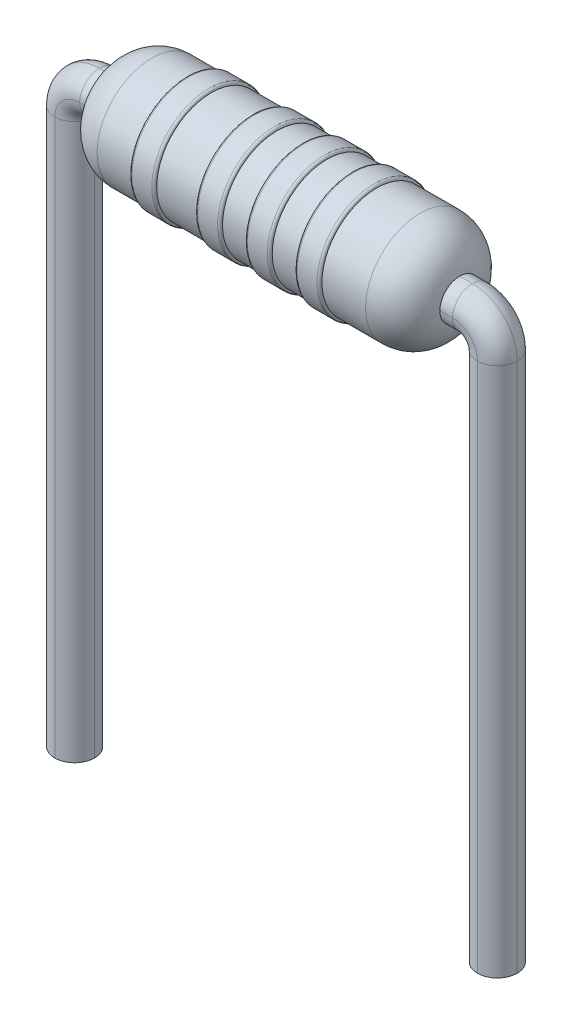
ISO-10303-21;
HEADER;
FILE_DESCRIPTION(('STEP AP214'),'2;1');
FILE_NAME('part.step','',(''),(''),'','','');
FILE_SCHEMA(('AUTOMOTIVE_DESIGN { 1 0 10303 214 1 1 1 1 }'));
ENDSEC;
DATA;
#1=APPLICATION_CONTEXT('core data for automotive mechanical design processes');
#2=APPLICATION_PROTOCOL_DEFINITION('international standard','automotive_design',2000,#1);
#3=PRODUCT_CONTEXT('',#1,'mechanical');
#4=PRODUCT('Part','Part','',(#3));
#5=PRODUCT_RELATED_PRODUCT_CATEGORY('part','',(#4));
#6=PRODUCT_DEFINITION_FORMATION('','',#4);
#7=PRODUCT_DEFINITION_CONTEXT('part definition',#1,'design');
#8=PRODUCT_DEFINITION('design','',#6,#7);
#9=PRODUCT_DEFINITION_SHAPE('','',#8);
#10=(LENGTH_UNIT() NAMED_UNIT(*) SI_UNIT(.MILLI.,.METRE.));
#11=(NAMED_UNIT(*) PLANE_ANGLE_UNIT() SI_UNIT($,.RADIAN.));
#12=(NAMED_UNIT(*) SI_UNIT($,.STERADIAN.) SOLID_ANGLE_UNIT());
#13=UNCERTAINTY_MEASURE_WITH_UNIT(LENGTH_MEASURE(1.E-05),#10,'distance_accuracy_value','');
#14=(GEOMETRIC_REPRESENTATION_CONTEXT(3) GLOBAL_UNCERTAINTY_ASSIGNED_CONTEXT((#13)) GLOBAL_UNIT_ASSIGNED_CONTEXT((#10,
#11,#12)) REPRESENTATION_CONTEXT('',''));
#15=CARTESIAN_POINT('',(0.,0.,0.));
#16=DIRECTION('',(0.,0.,1.));
#17=DIRECTION('',(1.,0.,0.));
#18=AXIS2_PLACEMENT_3D('',#15,#16,#17);
#19=CARTESIAN_POINT('',(2.7,0.,0.));
#20=DIRECTION('',(-1.,0.,0.));
#21=DIRECTION('',(0.,0.,1.));
#22=AXIS2_PLACEMENT_3D('',#19,#20,#21);
#23=DEGENERATE_TOROIDAL_SURFACE('',#22,0.3,0.8,.T.);
#24=CARTESIAN_POINT('',(3.49372539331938,0.,0.));
#25=DIRECTION('',(-1.,0.,0.));
#26=DIRECTION('',(0.,0.,1.));
#27=AXIS2_PLACEMENT_3D('',#24,#25,#26);
#28=CIRCLE('',#27,0.4);
#29=CARTESIAN_POINT('',(3.49372539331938,0.,-0.4));
#30=VERTEX_POINT('',#29);
#31=CARTESIAN_POINT('',(3.49372539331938,-0.4,0.));
#32=VERTEX_POINT('',#31);
#33=EDGE_CURVE('E31',#30,#32,#28,.T.);
#34=ORIENTED_EDGE('',*,*,#33,.T.);
#35=CARTESIAN_POINT('',(3.49372539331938,0.,0.));
#36=DIRECTION('',(1.,0.,0.));
#37=DIRECTION('',(0.,0.,-1.));
#38=AXIS2_PLACEMENT_3D('',#35,#36,#37);
#39=CIRCLE('',#38,0.4);
#40=CARTESIAN_POINT('',(3.49372539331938,0.,0.4));
#41=VERTEX_POINT('',#40);
#42=EDGE_CURVE('E11',#32,#41,#39,.F.);
#43=ORIENTED_EDGE('',*,*,#42,.T.);
#44=CARTESIAN_POINT('',(3.49372539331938,0.,0.));
#45=DIRECTION('',(-1.,0.,0.));
#46=DIRECTION('',(0.,0.,1.));
#47=AXIS2_PLACEMENT_3D('',#44,#45,#46);
#48=CIRCLE('',#47,0.4);
#49=CARTESIAN_POINT('',(3.49372539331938,0.4,0.));
#50=VERTEX_POINT('',#49);
#51=EDGE_CURVE('E339',#41,#50,#48,.T.);
#52=ORIENTED_EDGE('',*,*,#51,.T.);
#53=CARTESIAN_POINT('',(3.49372539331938,0.,0.));
#54=DIRECTION('',(1.,0.,0.));
#55=DIRECTION('',(0.,0.,-1.));
#56=AXIS2_PLACEMENT_3D('',#53,#54,#55);
#57=CIRCLE('',#56,0.4);
#58=EDGE_CURVE('E337',#50,#30,#57,.F.);
#59=ORIENTED_EDGE('',*,*,#58,.T.);
#60=EDGE_LOOP('',(#34,#43,#52,#59));
#61=FACE_BOUND('',#60,.T.);
#62=CARTESIAN_POINT('',(2.69999999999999,0.,0.));
#63=DIRECTION('',(-1.,0.,0.));
#64=DIRECTION('',(0.,0.,1.));
#65=AXIS2_PLACEMENT_3D('',#62,#63,#64);
#66=CIRCLE('',#65,1.1);
#67=CARTESIAN_POINT('',(2.69999999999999,0.,1.1));
#68=VERTEX_POINT('',#67);
#69=EDGE_CURVE('E269',#68,#68,#66,.T.);
#70=ORIENTED_EDGE('',*,*,#69,.F.);
#71=EDGE_LOOP('',(#70));
#72=FACE_BOUND('',#71,.T.);
#73=ADVANCED_FACE('F24',(#61,#72),#23,.T.);
#74=CARTESIAN_POINT('',(-2.7,0.,0.));
#75=DIRECTION('',(-1.,0.,0.));
#76=DIRECTION('',(0.,0.,1.));
#77=AXIS2_PLACEMENT_3D('',#74,#75,#76);
#78=DEGENERATE_TOROIDAL_SURFACE('',#77,0.3,0.8,.T.);
#79=CARTESIAN_POINT('',(-3.49372539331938,0.,0.));
#80=DIRECTION('',(-1.,0.,0.));
#81=DIRECTION('',(0.,0.,1.));
#82=AXIS2_PLACEMENT_3D('',#79,#80,#81);
#83=CIRCLE('',#82,0.4);
#84=CARTESIAN_POINT('',(-3.49372539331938,-0.4,0.));
#85=VERTEX_POINT('',#84);
#86=CARTESIAN_POINT('',(-3.49372539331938,0.,-0.4));
#87=VERTEX_POINT('',#86);
#88=EDGE_CURVE('E172',#85,#87,#83,.F.);
#89=ORIENTED_EDGE('',*,*,#88,.T.);
#90=CARTESIAN_POINT('',(-3.49372539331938,0.,0.));
#91=DIRECTION('',(1.,0.,0.));
#92=DIRECTION('',(0.,0.,-1.));
#93=AXIS2_PLACEMENT_3D('',#90,#91,#92);
#94=CIRCLE('',#93,0.4);
#95=CARTESIAN_POINT('',(-3.49372539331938,0.4,0.));
#96=VERTEX_POINT('',#95);
#97=EDGE_CURVE('E44',#87,#96,#94,.T.);
#98=ORIENTED_EDGE('',*,*,#97,.T.);
#99=CARTESIAN_POINT('',(-3.49372539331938,0.,0.));
#100=DIRECTION('',(-1.,0.,0.));
#101=DIRECTION('',(0.,0.,1.));
#102=AXIS2_PLACEMENT_3D('',#99,#100,#101);
#103=CIRCLE('',#102,0.4);
#104=CARTESIAN_POINT('',(-3.49372539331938,0.,0.4));
#105=VERTEX_POINT('',#104);
#106=EDGE_CURVE('E344',#96,#105,#103,.F.);
#107=ORIENTED_EDGE('',*,*,#106,.T.);
#108=CARTESIAN_POINT('',(-3.49372539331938,0.,0.));
#109=DIRECTION('',(1.,0.,0.));
#110=DIRECTION('',(0.,0.,-1.));
#111=AXIS2_PLACEMENT_3D('',#108,#109,#110);
#112=CIRCLE('',#111,0.4);
#113=EDGE_CURVE('E342',#105,#85,#112,.T.);
#114=ORIENTED_EDGE('',*,*,#113,.T.);
#115=EDGE_LOOP('',(#89,#98,#107,#114));
#116=FACE_BOUND('',#115,.T.);
#117=CARTESIAN_POINT('',(-2.69999999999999,0.,0.));
#118=DIRECTION('',(-1.,0.,0.));
#119=DIRECTION('',(0.,0.,1.));
#120=AXIS2_PLACEMENT_3D('',#117,#118,#119);
#121=CIRCLE('',#120,1.1);
#122=CARTESIAN_POINT('',(-2.69999999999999,0.,1.1));
#123=VERTEX_POINT('',#122);
#124=EDGE_CURVE('E266',#123,#123,#121,.T.);
#125=ORIENTED_EDGE('',*,*,#124,.T.);
#126=EDGE_LOOP('',(#125));
#127=FACE_BOUND('',#126,.T.);
#128=ADVANCED_FACE('F346',(#116,#127),#78,.T.);
#129=CARTESIAN_POINT('',(-54.2686615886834,0.,0.));
#130=DIRECTION('',(-1.,0.,0.));
#131=DIRECTION('',(0.,0.,1.));
#132=AXIS2_PLACEMENT_3D('',#129,#130,#131);
#133=CYLINDRICAL_SURFACE('',#132,1.1);
#134=CARTESIAN_POINT('',(0.322975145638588,0.,0.));
#135=DIRECTION('',(-1.,0.,0.));
#136=DIRECTION('',(0.,0.,1.));
#137=AXIS2_PLACEMENT_3D('',#134,#135,#136);
#138=CIRCLE('',#137,1.1);
#139=CARTESIAN_POINT('',(0.322975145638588,0.,1.1));
#140=VERTEX_POINT('',#139);
#141=EDGE_CURVE('E280',#140,#140,#138,.T.);
#142=ORIENTED_EDGE('',*,*,#141,.T.);
#143=EDGE_LOOP('',(#142));
#144=FACE_BOUND('',#143,.T.);
#145=CARTESIAN_POINT('',(-0.177024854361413,0.,0.));
#146=DIRECTION('',(1.,0.,0.));
#147=DIRECTION('',(0.,0.,-1.));
#148=AXIS2_PLACEMENT_3D('',#145,#146,#147);
#149=CIRCLE('',#148,1.1);
#150=CARTESIAN_POINT('',(-0.177024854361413,0.,-1.1));
#151=VERTEX_POINT('',#150);
#152=EDGE_CURVE('E270',#151,#151,#149,.T.);
#153=ORIENTED_EDGE('',*,*,#152,.T.);
#154=EDGE_LOOP('',(#153));
#155=FACE_BOUND('',#154,.T.);
#156=ADVANCED_FACE('F383',(#144,#155),#133,.T.);
#157=CARTESIAN_POINT('',(4.3261723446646,0.,0.));
#158=DIRECTION('',(1.,0.,0.));
#159=DIRECTION('',(0.,0.,-1.));
#160=AXIS2_PLACEMENT_3D('',#157,#158,#159);
#161=CYLINDRICAL_SURFACE('',#160,1.15);
#162=CARTESIAN_POINT('',(-0.627024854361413,0.,0.));
#163=DIRECTION('',(-1.,0.,0.));
#164=DIRECTION('',(0.,0.,1.));
#165=AXIS2_PLACEMENT_3D('',#162,#163,#164);
#166=CIRCLE('',#165,1.15);
#167=CARTESIAN_POINT('',(-0.627024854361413,0.,1.15));
#168=VERTEX_POINT('',#167);
#169=EDGE_CURVE('E304',#168,#168,#166,.F.);
#170=ORIENTED_EDGE('',*,*,#169,.T.);
#171=EDGE_LOOP('',(#170));
#172=FACE_BOUND('',#171,.T.);
#173=CARTESIAN_POINT('',(-0.227024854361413,0.,0.));
#174=DIRECTION('',(1.,0.,0.));
#175=DIRECTION('',(0.,0.,-1.));
#176=AXIS2_PLACEMENT_3D('',#173,#174,#175);
#177=CIRCLE('',#176,1.15);
#178=CARTESIAN_POINT('',(-0.227024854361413,0.,-1.15));
#179=VERTEX_POINT('',#178);
#180=EDGE_CURVE('E301',#179,#179,#177,.F.);
#181=ORIENTED_EDGE('',*,*,#180,.T.);
#182=EDGE_LOOP('',(#181));
#183=FACE_BOUND('',#182,.T.);
#184=ADVANCED_FACE('F418',(#172,#183),#161,.T.);
#185=CARTESIAN_POINT('',(-1.5,0.,0.));
#186=DIRECTION('',(1.,0.,0.));
#187=DIRECTION('',(0.,0.,-1.));
#188=AXIS2_PLACEMENT_3D('',#185,#186,#187);
#189=CIRCLE('',#188,1.1);
#190=CARTESIAN_POINT('',(-1.5,0.,-1.1));
#191=VERTEX_POINT('',#190);
#192=EDGE_CURVE('E265',#191,#191,#189,.T.);
#193=ORIENTED_EDGE('',*,*,#192,.T.);
#194=EDGE_LOOP('',(#193));
#195=FACE_BOUND('',#194,.T.);
#196=CARTESIAN_POINT('',(-0.677024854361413,0.,0.));
#197=DIRECTION('',(-1.,0.,0.));
#198=DIRECTION('',(0.,0.,1.));
#199=AXIS2_PLACEMENT_3D('',#196,#197,#198);
#200=CIRCLE('',#199,1.1);
#201=CARTESIAN_POINT('',(-0.677024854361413,0.,1.1));
#202=VERTEX_POINT('',#201);
#203=EDGE_CURVE('E274',#202,#202,#200,.T.);
#204=ORIENTED_EDGE('',*,*,#203,.T.);
#205=EDGE_LOOP('',(#204));
#206=FACE_BOUND('',#205,.T.);
#207=ADVANCED_FACE('F403',(#195,#206),#133,.T.);
#208=CARTESIAN_POINT('',(4.3261723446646,0.,0.));
#209=DIRECTION('',(1.,0.,0.));
#210=DIRECTION('',(0.,0.,-1.));
#211=AXIS2_PLACEMENT_3D('',#208,#209,#210);
#212=CYLINDRICAL_SURFACE('',#211,1.15);
#213=CARTESIAN_POINT('',(0.372975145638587,0.,0.));
#214=DIRECTION('',(-1.,0.,0.));
#215=DIRECTION('',(0.,0.,1.));
#216=AXIS2_PLACEMENT_3D('',#213,#214,#215);
#217=CIRCLE('',#216,1.15);
#218=CARTESIAN_POINT('',(0.372975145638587,0.,1.15));
#219=VERTEX_POINT('',#218);
#220=EDGE_CURVE('E310',#219,#219,#217,.F.);
#221=ORIENTED_EDGE('',*,*,#220,.T.);
#222=EDGE_LOOP('',(#221));
#223=FACE_BOUND('',#222,.T.);
#224=CARTESIAN_POINT('',(0.772975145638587,0.,0.));
#225=DIRECTION('',(1.,0.,0.));
#226=DIRECTION('',(0.,0.,-1.));
#227=AXIS2_PLACEMENT_3D('',#224,#225,#226);
#228=CIRCLE('',#227,1.15);
#229=CARTESIAN_POINT('',(0.772975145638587,0.,-1.15));
#230=VERTEX_POINT('',#229);
#231=EDGE_CURVE('E307',#230,#230,#228,.F.);
#232=ORIENTED_EDGE('',*,*,#231,.T.);
#233=EDGE_LOOP('',(#232));
#234=FACE_BOUND('',#233,.T.);
#235=ADVANCED_FACE('F405',(#223,#234),#212,.T.);
#236=CARTESIAN_POINT('',(1.32297514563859,0.,0.));
#237=DIRECTION('',(-1.,0.,0.));
#238=DIRECTION('',(0.,0.,1.));
#239=AXIS2_PLACEMENT_3D('',#236,#237,#238);
#240=CIRCLE('',#239,1.1);
#241=CARTESIAN_POINT('',(1.32297514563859,0.,1.1));
#242=VERTEX_POINT('',#241);
#243=EDGE_CURVE('E286',#242,#242,#240,.T.);
#244=ORIENTED_EDGE('',*,*,#243,.T.);
#245=EDGE_LOOP('',(#244));
#246=FACE_BOUND('',#245,.T.);
#247=CARTESIAN_POINT('',(0.822975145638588,0.,0.));
#248=DIRECTION('',(1.,0.,0.));
#249=DIRECTION('',(0.,0.,-1.));
#250=AXIS2_PLACEMENT_3D('',#247,#248,#249);
#251=CIRCLE('',#250,1.1);
#252=CARTESIAN_POINT('',(0.822975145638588,0.,-1.1));
#253=VERTEX_POINT('',#252);
#254=EDGE_CURVE('E277',#253,#253,#251,.T.);
#255=ORIENTED_EDGE('',*,*,#254,.T.);
#256=EDGE_LOOP('',(#255));
#257=FACE_BOUND('',#256,.T.);
#258=ADVANCED_FACE('F393',(#246,#257),#133,.T.);
#259=CARTESIAN_POINT('',(4.3261723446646,0.,0.));
#260=DIRECTION('',(1.,0.,0.));
#261=DIRECTION('',(0.,0.,-1.));
#262=AXIS2_PLACEMENT_3D('',#259,#260,#261);
#263=CYLINDRICAL_SURFACE('',#262,1.15);
#264=CARTESIAN_POINT('',(1.37297514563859,0.,0.));
#265=DIRECTION('',(-1.,0.,0.));
#266=DIRECTION('',(0.,0.,1.));
#267=AXIS2_PLACEMENT_3D('',#264,#265,#266);
#268=CIRCLE('',#267,1.15);
#269=CARTESIAN_POINT('',(1.37297514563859,0.,1.15));
#270=VERTEX_POINT('',#269);
#271=EDGE_CURVE('E316',#270,#270,#268,.F.);
#272=ORIENTED_EDGE('',*,*,#271,.T.);
#273=EDGE_LOOP('',(#272));
#274=FACE_BOUND('',#273,.T.);
#275=CARTESIAN_POINT('',(1.77297514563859,0.,0.));
#276=DIRECTION('',(1.,0.,0.));
#277=DIRECTION('',(0.,0.,-1.));
#278=AXIS2_PLACEMENT_3D('',#275,#276,#277);
#279=CIRCLE('',#278,1.15);
#280=CARTESIAN_POINT('',(1.77297514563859,0.,-1.15));
#281=VERTEX_POINT('',#280);
#282=EDGE_CURVE('E313',#281,#281,#279,.F.);
#283=ORIENTED_EDGE('',*,*,#282,.T.);
#284=EDGE_LOOP('',(#283));
#285=FACE_BOUND('',#284,.T.);
#286=ADVANCED_FACE('F391',(#274,#285),#263,.T.);
#287=CARTESIAN_POINT('',(1.82297514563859,0.,0.));
#288=DIRECTION('',(1.,0.,0.));
#289=DIRECTION('',(0.,0.,-1.));
#290=AXIS2_PLACEMENT_3D('',#287,#288,#289);
#291=CIRCLE('',#290,1.1);
#292=CARTESIAN_POINT('',(1.82297514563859,0.,-1.1));
#293=VERTEX_POINT('',#292);
#294=EDGE_CURVE('E283',#293,#293,#291,.T.);
#295=ORIENTED_EDGE('',*,*,#294,.T.);
#296=EDGE_LOOP('',(#295));
#297=FACE_BOUND('',#296,.T.);
#298=ORIENTED_EDGE('',*,*,#69,.T.);
#299=EDGE_LOOP('',(#298));
#300=FACE_BOUND('',#299,.T.);
#301=ADVANCED_FACE('F388',(#297,#300),#133,.T.);
#302=CARTESIAN_POINT('',(4.3261723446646,0.,0.));
#303=DIRECTION('',(1.,0.,0.));
#304=DIRECTION('',(0.,0.,-1.));
#305=AXIS2_PLACEMENT_3D('',#302,#303,#304);
#306=CYLINDRICAL_SURFACE('',#305,1.15);
#307=CARTESIAN_POINT('',(-1.95,0.,0.));
#308=DIRECTION('',(-1.,0.,0.));
#309=DIRECTION('',(0.,0.,1.));
#310=AXIS2_PLACEMENT_3D('',#307,#308,#309);
#311=CIRCLE('',#310,1.15);
#312=CARTESIAN_POINT('',(-1.95,0.,1.15));
#313=VERTEX_POINT('',#312);
#314=EDGE_CURVE('E298',#313,#313,#311,.F.);
#315=ORIENTED_EDGE('',*,*,#314,.T.);
#316=EDGE_LOOP('',(#315));
#317=FACE_BOUND('',#316,.T.);
#318=CARTESIAN_POINT('',(-1.55,0.,0.));
#319=DIRECTION('',(1.,0.,0.));
#320=DIRECTION('',(0.,0.,-1.));
#321=AXIS2_PLACEMENT_3D('',#318,#319,#320);
#322=CIRCLE('',#321,1.15);
#323=CARTESIAN_POINT('',(-1.55,0.,-1.15));
#324=VERTEX_POINT('',#323);
#325=EDGE_CURVE('E273',#324,#324,#322,.F.);
#326=ORIENTED_EDGE('',*,*,#325,.T.);
#327=EDGE_LOOP('',(#326));
#328=FACE_BOUND('',#327,.T.);
#329=ADVANCED_FACE('F390',(#317,#328),#306,.T.);
#330=CARTESIAN_POINT('',(-2.,0.,0.));
#331=DIRECTION('',(-1.,0.,0.));
#332=DIRECTION('',(0.,0.,1.));
#333=AXIS2_PLACEMENT_3D('',#330,#331,#332);
#334=CIRCLE('',#333,1.1);
#335=CARTESIAN_POINT('',(-2.,0.,1.1));
#336=VERTEX_POINT('',#335);
#337=EDGE_CURVE('E289',#336,#336,#334,.T.);
#338=ORIENTED_EDGE('',*,*,#337,.T.);
#339=EDGE_LOOP('',(#338));
#340=FACE_BOUND('',#339,.T.);
#341=ORIENTED_EDGE('',*,*,#124,.F.);
#342=EDGE_LOOP('',(#341));
#343=FACE_BOUND('',#342,.T.);
#344=ADVANCED_FACE('F394',(#340,#343),#133,.T.);
#345=CARTESIAN_POINT('',(-1.95,0.,0.));
#346=DIRECTION('',(-1.,0.,0.));
#347=DIRECTION('',(0.,0.,1.));
#348=AXIS2_PLACEMENT_3D('',#345,#346,#347);
#349=TOROIDAL_SURFACE('',#348,1.1,0.05);
#350=ORIENTED_EDGE('',*,*,#337,.F.);
#351=EDGE_LOOP('',(#350));
#352=FACE_BOUND('',#351,.T.);
#353=ORIENTED_EDGE('',*,*,#314,.F.);
#354=EDGE_LOOP('',(#353));
#355=FACE_BOUND('',#354,.T.);
#356=ADVANCED_FACE('F408',(#352,#355),#349,.T.);
#357=CARTESIAN_POINT('',(-1.55,0.,0.));
#358=DIRECTION('',(1.,0.,0.));
#359=DIRECTION('',(0.,0.,-1.));
#360=AXIS2_PLACEMENT_3D('',#357,#358,#359);
#361=TOROIDAL_SURFACE('',#360,1.1,0.05);
#362=ORIENTED_EDGE('',*,*,#325,.F.);
#363=EDGE_LOOP('',(#362));
#364=FACE_BOUND('',#363,.T.);
#365=ORIENTED_EDGE('',*,*,#192,.F.);
#366=EDGE_LOOP('',(#365));
#367=FACE_BOUND('',#366,.T.);
#368=ADVANCED_FACE('F413',(#364,#367),#361,.T.);
#369=CARTESIAN_POINT('',(-0.627024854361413,0.,0.));
#370=DIRECTION('',(-1.,0.,0.));
#371=DIRECTION('',(0.,0.,1.));
#372=AXIS2_PLACEMENT_3D('',#369,#370,#371);
#373=TOROIDAL_SURFACE('',#372,1.1,0.05);
#374=ORIENTED_EDGE('',*,*,#203,.F.);
#375=EDGE_LOOP('',(#374));
#376=FACE_BOUND('',#375,.T.);
#377=ORIENTED_EDGE('',*,*,#169,.F.);
#378=EDGE_LOOP('',(#377));
#379=FACE_BOUND('',#378,.T.);
#380=ADVANCED_FACE('F440',(#376,#379),#373,.T.);
#381=CARTESIAN_POINT('',(-0.227024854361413,0.,0.));
#382=DIRECTION('',(1.,0.,0.));
#383=DIRECTION('',(0.,0.,-1.));
#384=AXIS2_PLACEMENT_3D('',#381,#382,#383);
#385=TOROIDAL_SURFACE('',#384,1.1,0.05);
#386=ORIENTED_EDGE('',*,*,#180,.F.);
#387=EDGE_LOOP('',(#386));
#388=FACE_BOUND('',#387,.T.);
#389=ORIENTED_EDGE('',*,*,#152,.F.);
#390=EDGE_LOOP('',(#389));
#391=FACE_BOUND('',#390,.T.);
#392=ADVANCED_FACE('F437',(#388,#391),#385,.T.);
#393=CARTESIAN_POINT('',(0.372975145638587,0.,0.));
#394=DIRECTION('',(-1.,0.,0.));
#395=DIRECTION('',(0.,0.,1.));
#396=AXIS2_PLACEMENT_3D('',#393,#394,#395);
#397=TOROIDAL_SURFACE('',#396,1.1,0.05);
#398=ORIENTED_EDGE('',*,*,#141,.F.);
#399=EDGE_LOOP('',(#398));
#400=FACE_BOUND('',#399,.T.);
#401=ORIENTED_EDGE('',*,*,#220,.F.);
#402=EDGE_LOOP('',(#401));
#403=FACE_BOUND('',#402,.T.);
#404=ADVANCED_FACE('F439',(#400,#403),#397,.T.);
#405=CARTESIAN_POINT('',(0.772975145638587,0.,0.));
#406=DIRECTION('',(1.,0.,0.));
#407=DIRECTION('',(0.,0.,-1.));
#408=AXIS2_PLACEMENT_3D('',#405,#406,#407);
#409=TOROIDAL_SURFACE('',#408,1.1,0.05);
#410=ORIENTED_EDGE('',*,*,#231,.F.);
#411=EDGE_LOOP('',(#410));
#412=FACE_BOUND('',#411,.T.);
#413=ORIENTED_EDGE('',*,*,#254,.F.);
#414=EDGE_LOOP('',(#413));
#415=FACE_BOUND('',#414,.T.);
#416=ADVANCED_FACE('F447',(#412,#415),#409,.T.);
#417=CARTESIAN_POINT('',(1.37297514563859,0.,0.));
#418=DIRECTION('',(-1.,0.,0.));
#419=DIRECTION('',(0.,0.,1.));
#420=AXIS2_PLACEMENT_3D('',#417,#418,#419);
#421=TOROIDAL_SURFACE('',#420,1.1,0.05);
#422=ORIENTED_EDGE('',*,*,#243,.F.);
#423=EDGE_LOOP('',(#422));
#424=FACE_BOUND('',#423,.T.);
#425=ORIENTED_EDGE('',*,*,#271,.F.);
#426=EDGE_LOOP('',(#425));
#427=FACE_BOUND('',#426,.T.);
#428=ADVANCED_FACE('F535',(#424,#427),#421,.T.);
#429=CARTESIAN_POINT('',(1.77297514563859,0.,0.));
#430=DIRECTION('',(1.,0.,0.));
#431=DIRECTION('',(0.,0.,-1.));
#432=AXIS2_PLACEMENT_3D('',#429,#430,#431);
#433=TOROIDAL_SURFACE('',#432,1.1,0.05);
#434=ORIENTED_EDGE('',*,*,#282,.F.);
#435=EDGE_LOOP('',(#434));
#436=FACE_BOUND('',#435,.T.);
#437=ORIENTED_EDGE('',*,*,#294,.F.);
#438=EDGE_LOOP('',(#437));
#439=FACE_BOUND('',#438,.T.);
#440=ADVANCED_FACE('F516',(#436,#439),#433,.T.);
#441=CARTESIAN_POINT('',(-3.85,-11.6643596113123,0.4));
#442=DIRECTION('',(0.,1.,0.));
#443=DIRECTION('',(0.,0.,1.));
#444=AXIS2_PLACEMENT_3D('',#441,#442,#443);
#445=PLANE('',#444);
#446=CARTESIAN_POINT('',(-4.25,-11.6643596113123,0.));
#447=DIRECTION('',(0.,1.,0.));
#448=DIRECTION('',(0.,0.,1.));
#449=AXIS2_PLACEMENT_3D('',#446,#447,#448);
#450=CIRCLE('',#449,0.4);
#451=CARTESIAN_POINT('',(-4.65,-11.6643596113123,0.));
#452=VERTEX_POINT('',#451);
#453=CARTESIAN_POINT('',(-4.25,-11.6643596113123,-0.4));
#454=VERTEX_POINT('',#453);
#455=EDGE_CURVE('E328',#452,#454,#450,.F.);
#456=ORIENTED_EDGE('',*,*,#455,.T.);
#457=CARTESIAN_POINT('',(-4.25,-11.6643596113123,0.));
#458=DIRECTION('',(0.,1.,0.));
#459=DIRECTION('',(0.,0.,1.));
#460=AXIS2_PLACEMENT_3D('',#457,#458,#459);
#461=CIRCLE('',#460,0.4);
#462=CARTESIAN_POINT('',(-3.85,-11.6643596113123,0.));
#463=VERTEX_POINT('',#462);
#464=EDGE_CURVE('E334',#454,#463,#461,.F.);
#465=ORIENTED_EDGE('',*,*,#464,.T.);
#466=CARTESIAN_POINT('',(-4.25,-11.6643596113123,0.));
#467=DIRECTION('',(0.,1.,0.));
#468=DIRECTION('',(0.,0.,1.));
#469=AXIS2_PLACEMENT_3D('',#466,#467,#468);
#470=CIRCLE('',#469,0.4);
#471=CARTESIAN_POINT('',(-4.25,-11.6643596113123,0.4));
#472=VERTEX_POINT('',#471);
#473=EDGE_CURVE('E332',#463,#472,#470,.F.);
#474=ORIENTED_EDGE('',*,*,#473,.T.);
#475=CARTESIAN_POINT('',(-4.25,-11.6643596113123,0.));
#476=DIRECTION('',(0.,1.,0.));
#477=DIRECTION('',(0.,0.,1.));
#478=AXIS2_PLACEMENT_3D('',#475,#476,#477);
#479=CIRCLE('',#478,0.4);
#480=EDGE_CURVE('E330',#472,#452,#479,.F.);
#481=ORIENTED_EDGE('',*,*,#480,.T.);
#482=EDGE_LOOP('',(#456,#465,#474,#481));
#483=FACE_BOUND('',#482,.T.);
#484=ADVANCED_FACE('F510',(#483),#445,.F.);
#485=CARTESIAN_POINT('',(4.65,-11.1630338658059,0.4));
#486=DIRECTION('',(0.,1.,0.));
#487=DIRECTION('',(0.,0.,1.));
#488=AXIS2_PLACEMENT_3D('',#485,#486,#487);
#489=PLANE('',#488);
#490=CARTESIAN_POINT('',(4.25,-11.1630338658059,0.));
#491=DIRECTION('',(0.,1.,0.));
#492=DIRECTION('',(0.,0.,1.));
#493=AXIS2_PLACEMENT_3D('',#490,#491,#492);
#494=CIRCLE('',#493,0.4);
#495=CARTESIAN_POINT('',(3.85,-11.1630338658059,0.));
#496=VERTEX_POINT('',#495);
#497=CARTESIAN_POINT('',(4.25,-11.1630338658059,-0.4));
#498=VERTEX_POINT('',#497);
#499=EDGE_CURVE('E321',#496,#498,#494,.F.);
#500=ORIENTED_EDGE('',*,*,#499,.T.);
#501=CARTESIAN_POINT('',(4.25,-11.1630338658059,0.));
#502=DIRECTION('',(0.,1.,0.));
#503=DIRECTION('',(0.,0.,1.));
#504=AXIS2_PLACEMENT_3D('',#501,#502,#503);
#505=CIRCLE('',#504,0.4);
#506=CARTESIAN_POINT('',(4.65,-11.1630338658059,0.));
#507=VERTEX_POINT('',#506);
#508=EDGE_CURVE('E325',#498,#507,#505,.F.);
#509=ORIENTED_EDGE('',*,*,#508,.T.);
#510=CARTESIAN_POINT('',(4.25,-11.1630338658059,0.));
#511=DIRECTION('',(0.,1.,0.));
#512=DIRECTION('',(0.,0.,1.));
#513=AXIS2_PLACEMENT_3D('',#510,#511,#512);
#514=CIRCLE('',#513,0.4);
#515=CARTESIAN_POINT('',(4.25,-11.1630338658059,0.4));
#516=VERTEX_POINT('',#515);
#517=EDGE_CURVE('E323',#507,#516,#514,.F.);
#518=ORIENTED_EDGE('',*,*,#517,.T.);
#519=CARTESIAN_POINT('',(4.25,-11.1630338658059,0.));
#520=DIRECTION('',(0.,1.,0.));
#521=DIRECTION('',(0.,0.,1.));
#522=AXIS2_PLACEMENT_3D('',#519,#520,#521);
#523=CIRCLE('',#522,0.4);
#524=EDGE_CURVE('E319',#516,#496,#523,.F.);
#525=ORIENTED_EDGE('',*,*,#524,.T.);
#526=EDGE_LOOP('',(#500,#509,#518,#525));
#527=FACE_BOUND('',#526,.T.);
#528=ADVANCED_FACE('F515',(#527),#489,.F.);
#529=CARTESIAN_POINT('',(4.25,-0.5,0.));
#530=DIRECTION('',(0.,-1.,0.));
#531=DIRECTION('',(0.,0.,-1.));
#532=AXIS2_PLACEMENT_3D('',#529,#530,#531);
#533=CYLINDRICAL_SURFACE('',#532,0.4);
#534=DIRECTION('',(0.,-1.,0.));
#535=VECTOR('',#534,1.);
#536=CARTESIAN_POINT('',(3.85,-11.1630338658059,0.));
#537=LINE('',#536,#535);
#538=CARTESIAN_POINT('',(3.85,-0.500000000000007,0.));
#539=VERTEX_POINT('',#538);
#540=EDGE_CURVE('E263',#496,#539,#537,.F.);
#541=ORIENTED_EDGE('',*,*,#540,.F.);
#542=ORIENTED_EDGE('',*,*,#524,.F.);
#543=DIRECTION('',(0.,-1.,0.));
#544=VECTOR('',#543,1.);
#545=CARTESIAN_POINT('',(4.25,-0.5,0.4));
#546=LINE('',#545,#544);
#547=CARTESIAN_POINT('',(4.25,-0.500000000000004,0.4));
#548=VERTEX_POINT('',#547);
#549=EDGE_CURVE('E260',#548,#516,#546,.T.);
#550=ORIENTED_EDGE('',*,*,#549,.F.);
#551=CARTESIAN_POINT('',(4.25,-0.500000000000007,0.));
#552=DIRECTION('',(0.,1.,0.));
#553=DIRECTION('',(0.,0.,1.));
#554=AXIS2_PLACEMENT_3D('',#551,#552,#553);
#555=CIRCLE('',#554,0.4);
#556=EDGE_CURVE('E257',#539,#548,#555,.T.);
#557=ORIENTED_EDGE('',*,*,#556,.F.);
#558=EDGE_LOOP('',(#541,#542,#550,#557));
#559=FACE_BOUND('',#558,.T.);
#560=ADVANCED_FACE('F524',(#559),#533,.T.);
#561=CARTESIAN_POINT('',(4.25,-11.1630338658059,0.));
#562=DIRECTION('',(0.,1.,0.));
#563=DIRECTION('',(0.,0.,1.));
#564=AXIS2_PLACEMENT_3D('',#561,#562,#563);
#565=CYLINDRICAL_SURFACE('',#564,0.4);
#566=ORIENTED_EDGE('',*,*,#499,.F.);
#567=ORIENTED_EDGE('',*,*,#540,.T.);
#568=CARTESIAN_POINT('',(4.25,-0.500000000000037,0.));
#569=DIRECTION('',(0.,1.,0.));
#570=DIRECTION('',(-1.,0.,0.));
#571=AXIS2_PLACEMENT_3D('',#568,#569,#570);
#572=CIRCLE('',#571,0.4);
#573=CARTESIAN_POINT('',(4.25,-0.500000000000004,-0.4));
#574=VERTEX_POINT('',#573);
#575=EDGE_CURVE('E252',#574,#539,#572,.T.);
#576=ORIENTED_EDGE('',*,*,#575,.F.);
#577=DIRECTION('',(0.,-1.,0.));
#578=VECTOR('',#577,1.);
#579=CARTESIAN_POINT('',(4.25,-0.500000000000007,-0.4));
#580=LINE('',#579,#578);
#581=EDGE_CURVE('E249',#498,#574,#580,.F.);
#582=ORIENTED_EDGE('',*,*,#581,.F.);
#583=EDGE_LOOP('',(#566,#567,#576,#582));
#584=FACE_BOUND('',#583,.T.);
#585=ADVANCED_FACE('F558',(#584),#565,.T.);
#586=CARTESIAN_POINT('',(4.25,-0.5,0.));
#587=DIRECTION('',(0.,1.,0.));
#588=DIRECTION('',(0.,0.,1.));
#589=AXIS2_PLACEMENT_3D('',#586,#587,#588);
#590=CYLINDRICAL_SURFACE('',#589,0.4);
#591=ORIENTED_EDGE('',*,*,#549,.T.);
#592=ORIENTED_EDGE('',*,*,#517,.F.);
#593=DIRECTION('',(0.,1.,0.));
#594=VECTOR('',#593,1.);
#595=CARTESIAN_POINT('',(4.65,-11.1630338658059,0.));
#596=LINE('',#595,#594);
#597=CARTESIAN_POINT('',(4.65,-0.500000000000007,0.));
#598=VERTEX_POINT('',#597);
#599=EDGE_CURVE('E247',#598,#507,#596,.F.);
#600=ORIENTED_EDGE('',*,*,#599,.F.);
#601=CARTESIAN_POINT('',(4.25,-0.500000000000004,0.));
#602=DIRECTION('',(0.,1.,0.));
#603=DIRECTION('',(-1.,0.,0.));
#604=AXIS2_PLACEMENT_3D('',#601,#602,#603);
#605=CIRCLE('',#604,0.4);
#606=EDGE_CURVE('E244',#548,#598,#605,.T.);
#607=ORIENTED_EDGE('',*,*,#606,.F.);
#608=EDGE_LOOP('',(#591,#592,#600,#607));
#609=FACE_BOUND('',#608,.T.);
#610=ADVANCED_FACE('F562',(#609),#590,.T.);
#611=CARTESIAN_POINT('',(3.75,-0.5,0.));
#612=DIRECTION('',(0.,0.,-1.));
#613=DIRECTION('',(-1.,0.,0.));
#614=AXIS2_PLACEMENT_3D('',#611,#612,#613);
#615=TOROIDAL_SURFACE('',#614,0.5,0.4);
#616=CARTESIAN_POINT('',(3.75,-0.5,0.));
#617=DIRECTION('',(0.,0.,-1.));
#618=DIRECTION('',(-1.,0.,0.));
#619=AXIS2_PLACEMENT_3D('',#616,#617,#618);
#620=CIRCLE('',#619,0.0999999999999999);
#621=CARTESIAN_POINT('',(3.75,-0.4,0.));
#622=VERTEX_POINT('',#621);
#623=EDGE_CURVE('E255',#539,#622,#620,.F.);
#624=ORIENTED_EDGE('',*,*,#623,.F.);
#625=ORIENTED_EDGE('',*,*,#556,.T.);
#626=CARTESIAN_POINT('',(3.75,-0.5,0.4));
#627=DIRECTION('',(0.,0.,-1.));
#628=DIRECTION('',(-1.,0.,0.));
#629=AXIS2_PLACEMENT_3D('',#626,#627,#628);
#630=CIRCLE('',#629,0.5);
#631=CARTESIAN_POINT('',(3.75,0.,0.4));
#632=VERTEX_POINT('',#631);
#633=EDGE_CURVE('E241',#632,#548,#630,.T.);
#634=ORIENTED_EDGE('',*,*,#633,.F.);
#635=CARTESIAN_POINT('',(3.74999999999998,0.,0.));
#636=DIRECTION('',(-1.,0.,0.));
#637=DIRECTION('',(0.,0.,1.));
#638=AXIS2_PLACEMENT_3D('',#635,#636,#637);
#639=CIRCLE('',#638,0.4);
#640=EDGE_CURVE('E238',#622,#632,#639,.T.);
#641=ORIENTED_EDGE('',*,*,#640,.F.);
#642=EDGE_LOOP('',(#624,#625,#634,#641));
#643=FACE_BOUND('',#642,.T.);
#644=ADVANCED_FACE('F566',(#643),#615,.T.);
#645=CARTESIAN_POINT('',(3.75,-0.5,0.));
#646=DIRECTION('',(0.,0.,-1.));
#647=DIRECTION('',(-1.,0.,0.));
#648=AXIS2_PLACEMENT_3D('',#645,#646,#647);
#649=TOROIDAL_SURFACE('',#648,0.5,0.4);
#650=ORIENTED_EDGE('',*,*,#575,.T.);
#651=ORIENTED_EDGE('',*,*,#623,.T.);
#652=CARTESIAN_POINT('',(3.75,0.,0.));
#653=DIRECTION('',(-1.,0.,0.));
#654=DIRECTION('',(0.,0.,1.));
#655=AXIS2_PLACEMENT_3D('',#652,#653,#654);
#656=CIRCLE('',#655,0.4);
#657=CARTESIAN_POINT('',(3.75,0.,-0.4));
#658=VERTEX_POINT('',#657);
#659=EDGE_CURVE('E232',#658,#622,#656,.T.);
#660=ORIENTED_EDGE('',*,*,#659,.F.);
#661=CARTESIAN_POINT('',(3.75,-0.5,-0.4));
#662=DIRECTION('',(0.,0.,-1.));
#663=DIRECTION('',(-1.,0.,0.));
#664=AXIS2_PLACEMENT_3D('',#661,#662,#663);
#665=CIRCLE('',#664,0.5);
#666=EDGE_CURVE('E229',#574,#658,#665,.F.);
#667=ORIENTED_EDGE('',*,*,#666,.F.);
#668=EDGE_LOOP('',(#650,#651,#660,#667));
#669=FACE_BOUND('',#668,.T.);
#670=ADVANCED_FACE('F570',(#669),#649,.T.);
#671=CARTESIAN_POINT('',(4.25,-11.1630338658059,0.));
#672=DIRECTION('',(0.,-1.,0.));
#673=DIRECTION('',(0.,0.,-1.));
#674=AXIS2_PLACEMENT_3D('',#671,#672,#673);
#675=CYLINDRICAL_SURFACE('',#674,0.4);
#676=ORIENTED_EDGE('',*,*,#508,.F.);
#677=ORIENTED_EDGE('',*,*,#581,.T.);
#678=CARTESIAN_POINT('',(4.25,-0.500000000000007,0.));
#679=DIRECTION('',(0.,1.,0.));
#680=DIRECTION('',(0.,0.,1.));
#681=AXIS2_PLACEMENT_3D('',#678,#679,#680);
#682=CIRCLE('',#681,0.4);
#683=EDGE_CURVE('E226',#598,#574,#682,.T.);
#684=ORIENTED_EDGE('',*,*,#683,.F.);
#685=ORIENTED_EDGE('',*,*,#599,.T.);
#686=EDGE_LOOP('',(#676,#677,#684,#685));
#687=FACE_BOUND('',#686,.T.);
#688=ADVANCED_FACE('F574',(#687),#675,.T.);
#689=CARTESIAN_POINT('',(3.75,-0.5,0.));
#690=DIRECTION('',(0.,0.,-1.));
#691=DIRECTION('',(-1.,0.,0.));
#692=AXIS2_PLACEMENT_3D('',#689,#690,#691);
#693=TOROIDAL_SURFACE('',#692,0.5,0.4);
#694=ORIENTED_EDGE('',*,*,#633,.T.);
#695=ORIENTED_EDGE('',*,*,#606,.T.);
#696=CARTESIAN_POINT('',(3.75,-0.5,0.));
#697=DIRECTION('',(0.,0.,-1.));
#698=DIRECTION('',(-1.,0.,0.));
#699=AXIS2_PLACEMENT_3D('',#696,#697,#698);
#700=CIRCLE('',#699,0.9);
#701=CARTESIAN_POINT('',(3.75,0.4,0.));
#702=VERTEX_POINT('',#701);
#703=EDGE_CURVE('E223',#702,#598,#700,.T.);
#704=ORIENTED_EDGE('',*,*,#703,.F.);
#705=CARTESIAN_POINT('',(3.75,0.,0.));
#706=DIRECTION('',(-1.,0.,0.));
#707=DIRECTION('',(0.,0.,1.));
#708=AXIS2_PLACEMENT_3D('',#705,#706,#707);
#709=CIRCLE('',#708,0.4);
#710=EDGE_CURVE('E220',#632,#702,#709,.T.);
#711=ORIENTED_EDGE('',*,*,#710,.F.);
#712=EDGE_LOOP('',(#694,#695,#704,#711));
#713=FACE_BOUND('',#712,.T.);
#714=ADVANCED_FACE('F578',(#713),#693,.T.);
#715=CARTESIAN_POINT('',(-3.75,0.,0.));
#716=DIRECTION('',(1.,0.,0.));
#717=DIRECTION('',(0.,0.,-1.));
#718=AXIS2_PLACEMENT_3D('',#715,#716,#717);
#719=CYLINDRICAL_SURFACE('',#718,0.4);
#720=DIRECTION('',(1.,0.,0.));
#721=VECTOR('',#720,1.);
#722=CARTESIAN_POINT('',(-3.75,0.,0.4));
#723=LINE('',#722,#721);
#724=EDGE_CURVE('E217',#41,#632,#723,.T.);
#725=ORIENTED_EDGE('',*,*,#724,.F.);
#726=ORIENTED_EDGE('',*,*,#42,.F.);
#727=DIRECTION('',(1.,0.,0.));
#728=VECTOR('',#727,1.);
#729=CARTESIAN_POINT('',(3.75,-0.4,0.));
#730=LINE('',#729,#728);
#731=EDGE_CURVE('E235',#622,#32,#730,.F.);
#732=ORIENTED_EDGE('',*,*,#731,.F.);
#733=ORIENTED_EDGE('',*,*,#640,.T.);
#734=EDGE_LOOP('',(#725,#726,#732,#733));
#735=FACE_BOUND('',#734,.T.);
#736=ADVANCED_FACE('F582',(#735),#719,.T.);
#737=CARTESIAN_POINT('',(3.75,0.,0.));
#738=DIRECTION('',(-1.,0.,0.));
#739=DIRECTION('',(0.,0.,1.));
#740=AXIS2_PLACEMENT_3D('',#737,#738,#739);
#741=CYLINDRICAL_SURFACE('',#740,0.4);
#742=ORIENTED_EDGE('',*,*,#731,.T.);
#743=ORIENTED_EDGE('',*,*,#33,.F.);
#744=DIRECTION('',(1.,0.,0.));
#745=VECTOR('',#744,1.);
#746=CARTESIAN_POINT('',(3.45459343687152,0.,-0.4));
#747=LINE('',#746,#745);
#748=EDGE_CURVE('E215',#658,#30,#747,.F.);
#749=ORIENTED_EDGE('',*,*,#748,.F.);
#750=ORIENTED_EDGE('',*,*,#659,.T.);
#751=EDGE_LOOP('',(#742,#743,#749,#750));
#752=FACE_BOUND('',#751,.T.);
#753=ADVANCED_FACE('F586',(#752),#741,.T.);
#754=CARTESIAN_POINT('',(3.75,-0.5,0.));
#755=DIRECTION('',(0.,0.,-1.));
#756=DIRECTION('',(-1.,0.,0.));
#757=AXIS2_PLACEMENT_3D('',#754,#755,#756);
#758=TOROIDAL_SURFACE('',#757,0.5,0.4);
#759=ORIENTED_EDGE('',*,*,#683,.T.);
#760=ORIENTED_EDGE('',*,*,#666,.T.);
#761=CARTESIAN_POINT('',(3.75,0.,0.));
#762=DIRECTION('',(-1.,0.,0.));
#763=DIRECTION('',(0.,-1.,0.));
#764=AXIS2_PLACEMENT_3D('',#761,#762,#763);
#765=CIRCLE('',#764,0.4);
#766=EDGE_CURVE('E212',#702,#658,#765,.T.);
#767=ORIENTED_EDGE('',*,*,#766,.F.);
#768=ORIENTED_EDGE('',*,*,#703,.T.);
#769=EDGE_LOOP('',(#759,#760,#767,#768));
#770=FACE_BOUND('',#769,.T.);
#771=ADVANCED_FACE('F590',(#770),#758,.T.);
#772=CARTESIAN_POINT('',(-3.75,0.,0.));
#773=DIRECTION('',(-1.,0.,0.));
#774=DIRECTION('',(0.,0.,1.));
#775=AXIS2_PLACEMENT_3D('',#772,#773,#774);
#776=CYLINDRICAL_SURFACE('',#775,0.4);
#777=ORIENTED_EDGE('',*,*,#724,.T.);
#778=ORIENTED_EDGE('',*,*,#710,.T.);
#779=DIRECTION('',(-1.,0.,0.));
#780=VECTOR('',#779,1.);
#781=CARTESIAN_POINT('',(3.75,0.4,0.));
#782=LINE('',#781,#780);
#783=EDGE_CURVE('E209',#50,#702,#782,.F.);
#784=ORIENTED_EDGE('',*,*,#783,.F.);
#785=ORIENTED_EDGE('',*,*,#51,.F.);
#786=EDGE_LOOP('',(#777,#778,#784,#785));
#787=FACE_BOUND('',#786,.T.);
#788=ADVANCED_FACE('F594',(#787),#776,.T.);
#789=CARTESIAN_POINT('',(3.75,0.,0.));
#790=DIRECTION('',(1.,0.,0.));
#791=DIRECTION('',(0.,0.,-1.));
#792=AXIS2_PLACEMENT_3D('',#789,#790,#791);
#793=CYLINDRICAL_SURFACE('',#792,0.4);
#794=ORIENTED_EDGE('',*,*,#766,.T.);
#795=ORIENTED_EDGE('',*,*,#748,.T.);
#796=ORIENTED_EDGE('',*,*,#58,.F.);
#797=ORIENTED_EDGE('',*,*,#783,.T.);
#798=EDGE_LOOP('',(#794,#795,#796,#797));
#799=FACE_BOUND('',#798,.T.);
#800=ADVANCED_FACE('F598',(#799),#793,.T.);
#801=CARTESIAN_POINT('',(-4.25,-0.5,0.));
#802=DIRECTION('',(0.,-1.,0.));
#803=DIRECTION('',(0.,0.,-1.));
#804=AXIS2_PLACEMENT_3D('',#801,#802,#803);
#805=CYLINDRICAL_SURFACE('',#804,0.4);
#806=DIRECTION('',(0.,-1.,0.));
#807=VECTOR('',#806,1.);
#808=CARTESIAN_POINT('',(-4.65,-0.500000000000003,0.));
#809=LINE('',#808,#807);
#810=CARTESIAN_POINT('',(-4.65,-0.500000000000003,0.));
#811=VERTEX_POINT('',#810);
#812=EDGE_CURVE('E207',#452,#811,#809,.F.);
#813=ORIENTED_EDGE('',*,*,#812,.F.);
#814=ORIENTED_EDGE('',*,*,#480,.F.);
#815=DIRECTION('',(0.,-1.,0.));
#816=VECTOR('',#815,1.);
#817=CARTESIAN_POINT('',(-4.25,-0.5,0.4));
#818=LINE('',#817,#816);
#819=CARTESIAN_POINT('',(-4.25,-0.500000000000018,0.4));
#820=VERTEX_POINT('',#819);
#821=EDGE_CURVE('E204',#820,#472,#818,.T.);
#822=ORIENTED_EDGE('',*,*,#821,.F.);
#823=CARTESIAN_POINT('',(-4.25,-0.500000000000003,0.));
#824=DIRECTION('',(0.,1.,0.));
#825=DIRECTION('',(0.,0.,1.));
#826=AXIS2_PLACEMENT_3D('',#823,#824,#825);
#827=CIRCLE('',#826,0.4);
#828=EDGE_CURVE('E201',#811,#820,#827,.T.);
#829=ORIENTED_EDGE('',*,*,#828,.F.);
#830=EDGE_LOOP('',(#813,#814,#822,#829));
#831=FACE_BOUND('',#830,.T.);
#832=ADVANCED_FACE('F602',(#831),#805,.T.);
#833=CARTESIAN_POINT('',(-4.25,-0.500000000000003,0.));
#834=DIRECTION('',(0.,1.,0.));
#835=DIRECTION('',(0.,0.,1.));
#836=AXIS2_PLACEMENT_3D('',#833,#834,#835);
#837=CYLINDRICAL_SURFACE('',#836,0.4);
#838=ORIENTED_EDGE('',*,*,#455,.F.);
#839=ORIENTED_EDGE('',*,*,#812,.T.);
#840=CARTESIAN_POINT('',(-4.25,-0.500000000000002,0.));
#841=DIRECTION('',(0.,1.,0.));
#842=DIRECTION('',(-1.,0.,0.));
#843=AXIS2_PLACEMENT_3D('',#840,#841,#842);
#844=CIRCLE('',#843,0.4);
#845=CARTESIAN_POINT('',(-4.25,-0.500000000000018,-0.4));
#846=VERTEX_POINT('',#845);
#847=EDGE_CURVE('E196',#846,#811,#844,.T.);
#848=ORIENTED_EDGE('',*,*,#847,.F.);
#849=DIRECTION('',(0.,-1.,0.));
#850=VECTOR('',#849,1.);
#851=CARTESIAN_POINT('',(-4.25,-0.500000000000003,-0.4));
#852=LINE('',#851,#850);
#853=EDGE_CURVE('E193',#454,#846,#852,.F.);
#854=ORIENTED_EDGE('',*,*,#853,.F.);
#855=EDGE_LOOP('',(#838,#839,#848,#854));
#856=FACE_BOUND('',#855,.T.);
#857=ADVANCED_FACE('F606',(#856),#837,.T.);
#858=CARTESIAN_POINT('',(-4.25,-0.5,0.));
#859=DIRECTION('',(0.,1.,0.));
#860=DIRECTION('',(0.,0.,1.));
#861=AXIS2_PLACEMENT_3D('',#858,#859,#860);
#862=CYLINDRICAL_SURFACE('',#861,0.4);
#863=ORIENTED_EDGE('',*,*,#821,.T.);
#864=ORIENTED_EDGE('',*,*,#473,.F.);
#865=DIRECTION('',(0.,1.,0.));
#866=VECTOR('',#865,1.);
#867=CARTESIAN_POINT('',(-3.85,-0.500000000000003,0.));
#868=LINE('',#867,#866);
#869=CARTESIAN_POINT('',(-3.85,-0.500000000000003,0.));
#870=VERTEX_POINT('',#869);
#871=EDGE_CURVE('E191',#870,#463,#868,.F.);
#872=ORIENTED_EDGE('',*,*,#871,.F.);
#873=CARTESIAN_POINT('',(-4.25,-0.500000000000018,0.));
#874=DIRECTION('',(0.,1.,0.));
#875=DIRECTION('',(-1.,0.,0.));
#876=AXIS2_PLACEMENT_3D('',#873,#874,#875);
#877=CIRCLE('',#876,0.4);
#878=EDGE_CURVE('E144',#820,#870,#877,.T.);
#879=ORIENTED_EDGE('',*,*,#878,.F.);
#880=EDGE_LOOP('',(#863,#864,#872,#879));
#881=FACE_BOUND('',#880,.T.);
#882=ADVANCED_FACE('F359',(#881),#862,.T.);
#883=CARTESIAN_POINT('',(-3.75,-0.5,0.));
#884=DIRECTION('',(0.,0.,-1.));
#885=DIRECTION('',(-1.,0.,0.));
#886=AXIS2_PLACEMENT_3D('',#883,#884,#885);
#887=TOROIDAL_SURFACE('',#886,0.5,0.4);
#888=CARTESIAN_POINT('',(-3.75,-0.5,0.));
#889=DIRECTION('',(0.,0.,-1.));
#890=DIRECTION('',(-1.,0.,0.));
#891=AXIS2_PLACEMENT_3D('',#888,#889,#890);
#892=CIRCLE('',#891,0.9);
#893=CARTESIAN_POINT('',(-3.75,0.4,0.));
#894=VERTEX_POINT('',#893);
#895=EDGE_CURVE('E199',#811,#894,#892,.T.);
#896=ORIENTED_EDGE('',*,*,#895,.F.);
#897=ORIENTED_EDGE('',*,*,#828,.T.);
#898=CARTESIAN_POINT('',(-3.75,-0.5,0.4));
#899=DIRECTION('',(0.,0.,-1.));
#900=DIRECTION('',(-1.,0.,0.));
#901=AXIS2_PLACEMENT_3D('',#898,#899,#900);
#902=CIRCLE('',#901,0.5);
#903=CARTESIAN_POINT('',(-3.75,0.,0.4));
#904=VERTEX_POINT('',#903);
#905=EDGE_CURVE('E188',#904,#820,#902,.F.);
#906=ORIENTED_EDGE('',*,*,#905,.F.);
#907=CARTESIAN_POINT('',(-3.75,0.,0.));
#908=DIRECTION('',(1.,0.,0.));
#909=DIRECTION('',(0.,1.,0.));
#910=AXIS2_PLACEMENT_3D('',#907,#908,#909);
#911=CIRCLE('',#910,0.4);
#912=EDGE_CURVE('E185',#894,#904,#911,.T.);
#913=ORIENTED_EDGE('',*,*,#912,.F.);
#914=EDGE_LOOP('',(#896,#897,#906,#913));
#915=FACE_BOUND('',#914,.T.);
#916=ADVANCED_FACE('F354',(#915),#887,.T.);
#917=CARTESIAN_POINT('',(-3.75,-0.5,0.));
#918=DIRECTION('',(0.,0.,-1.));
#919=DIRECTION('',(-1.,0.,0.));
#920=AXIS2_PLACEMENT_3D('',#917,#918,#919);
#921=TOROIDAL_SURFACE('',#920,0.5,0.4);
#922=ORIENTED_EDGE('',*,*,#847,.T.);
#923=ORIENTED_EDGE('',*,*,#895,.T.);
#924=CARTESIAN_POINT('',(-3.75,0.,0.));
#925=DIRECTION('',(1.,0.,0.));
#926=DIRECTION('',(0.,0.,-1.));
#927=AXIS2_PLACEMENT_3D('',#924,#925,#926);
#928=CIRCLE('',#927,0.4);
#929=CARTESIAN_POINT('',(-3.75,0.,-0.4));
#930=VERTEX_POINT('',#929);
#931=EDGE_CURVE('E179',#930,#894,#928,.T.);
#932=ORIENTED_EDGE('',*,*,#931,.F.);
#933=CARTESIAN_POINT('',(-3.75,-0.5,-0.4));
#934=DIRECTION('',(0.,0.,-1.));
#935=DIRECTION('',(-1.,0.,0.));
#936=AXIS2_PLACEMENT_3D('',#933,#934,#935);
#937=CIRCLE('',#936,0.5);
#938=EDGE_CURVE('E166',#846,#930,#937,.T.);
#939=ORIENTED_EDGE('',*,*,#938,.F.);
#940=EDGE_LOOP('',(#922,#923,#932,#939));
#941=FACE_BOUND('',#940,.T.);
#942=ADVANCED_FACE('F368',(#941),#921,.T.);
#943=CARTESIAN_POINT('',(-4.25,-0.500000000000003,0.));
#944=DIRECTION('',(0.,-1.,0.));
#945=DIRECTION('',(0.,0.,-1.));
#946=AXIS2_PLACEMENT_3D('',#943,#944,#945);
#947=CYLINDRICAL_SURFACE('',#946,0.4);
#948=ORIENTED_EDGE('',*,*,#464,.F.);
#949=ORIENTED_EDGE('',*,*,#853,.T.);
#950=CARTESIAN_POINT('',(-4.25,-0.500000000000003,0.));
#951=DIRECTION('',(0.,1.,0.));
#952=DIRECTION('',(0.,0.,1.));
#953=AXIS2_PLACEMENT_3D('',#950,#951,#952);
#954=CIRCLE('',#953,0.4);
#955=EDGE_CURVE('E149',#870,#846,#954,.T.);
#956=ORIENTED_EDGE('',*,*,#955,.F.);
#957=ORIENTED_EDGE('',*,*,#871,.T.);
#958=EDGE_LOOP('',(#948,#949,#956,#957));
#959=FACE_BOUND('',#958,.T.);
#960=ADVANCED_FACE('F363',(#959),#947,.T.);
#961=CARTESIAN_POINT('',(-3.75,-0.5,0.));
#962=DIRECTION('',(0.,0.,-1.));
#963=DIRECTION('',(-1.,0.,0.));
#964=AXIS2_PLACEMENT_3D('',#961,#962,#963);
#965=TOROIDAL_SURFACE('',#964,0.5,0.4);
#966=ORIENTED_EDGE('',*,*,#905,.T.);
#967=ORIENTED_EDGE('',*,*,#878,.T.);
#968=CARTESIAN_POINT('',(-3.75,-0.5,0.));
#969=DIRECTION('',(0.,0.,-1.));
#970=DIRECTION('',(-1.,0.,0.));
#971=AXIS2_PLACEMENT_3D('',#968,#969,#970);
#972=CIRCLE('',#971,0.0999999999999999);
#973=CARTESIAN_POINT('',(-3.75,-0.4,0.));
#974=VERTEX_POINT('',#973);
#975=EDGE_CURVE('E137',#974,#870,#972,.F.);
#976=ORIENTED_EDGE('',*,*,#975,.F.);
#977=CARTESIAN_POINT('',(-3.75,0.,0.));
#978=DIRECTION('',(1.,0.,0.));
#979=DIRECTION('',(0.,0.,-1.));
#980=AXIS2_PLACEMENT_3D('',#977,#978,#979);
#981=CIRCLE('',#980,0.4);
#982=EDGE_CURVE('E141',#904,#974,#981,.T.);
#983=ORIENTED_EDGE('',*,*,#982,.F.);
#984=EDGE_LOOP('',(#966,#967,#976,#983));
#985=FACE_BOUND('',#984,.T.);
#986=ADVANCED_FACE('F140',(#985),#965,.T.);
#987=CARTESIAN_POINT('',(-3.75,0.,0.));
#988=DIRECTION('',(-1.,0.,0.));
#989=DIRECTION('',(0.,0.,1.));
#990=AXIS2_PLACEMENT_3D('',#987,#988,#989);
#991=CYLINDRICAL_SURFACE('',#990,0.4);
#992=DIRECTION('',(-1.,0.,0.));
#993=VECTOR('',#992,1.);
#994=CARTESIAN_POINT('',(-3.75,0.,0.4));
#995=LINE('',#994,#993);
#996=EDGE_CURVE('E159',#105,#904,#995,.T.);
#997=ORIENTED_EDGE('',*,*,#996,.F.);
#998=ORIENTED_EDGE('',*,*,#106,.F.);
#999=DIRECTION('',(-1.,0.,0.));
#1000=VECTOR('',#999,1.);
#1001=CARTESIAN_POINT('',(3.75,0.4,0.));
#1002=LINE('',#1001,#1000);
#1003=EDGE_CURVE('E182',#894,#96,#1002,.F.);
#1004=ORIENTED_EDGE('',*,*,#1003,.F.);
#1005=ORIENTED_EDGE('',*,*,#912,.T.);
#1006=EDGE_LOOP('',(#997,#998,#1004,#1005));
#1007=FACE_BOUND('',#1006,.T.);
#1008=ADVANCED_FACE('F350',(#1007),#991,.T.);
#1009=CARTESIAN_POINT('',(3.75,0.,0.));
#1010=DIRECTION('',(1.,0.,0.));
#1011=DIRECTION('',(0.,0.,-1.));
#1012=AXIS2_PLACEMENT_3D('',#1009,#1010,#1011);
#1013=CYLINDRICAL_SURFACE('',#1012,0.4);
#1014=ORIENTED_EDGE('',*,*,#1003,.T.);
#1015=ORIENTED_EDGE('',*,*,#97,.F.);
#1016=DIRECTION('',(-1.,0.,0.));
#1017=VECTOR('',#1016,1.);
#1018=CARTESIAN_POINT('',(-3.45459343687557,0.,-0.4));
#1019=LINE('',#1018,#1017);
#1020=EDGE_CURVE('E169',#930,#87,#1019,.F.);
#1021=ORIENTED_EDGE('',*,*,#1020,.F.);
#1022=ORIENTED_EDGE('',*,*,#931,.T.);
#1023=EDGE_LOOP('',(#1014,#1015,#1021,#1022));
#1024=FACE_BOUND('',#1023,.T.);
#1025=ADVANCED_FACE('F370',(#1024),#1013,.T.);
#1026=CARTESIAN_POINT('',(-3.75,-0.5,0.));
#1027=DIRECTION('',(0.,0.,-1.));
#1028=DIRECTION('',(-1.,0.,0.));
#1029=AXIS2_PLACEMENT_3D('',#1026,#1027,#1028);
#1030=TOROIDAL_SURFACE('',#1029,0.5,0.4);
#1031=ORIENTED_EDGE('',*,*,#955,.T.);
#1032=ORIENTED_EDGE('',*,*,#938,.T.);
#1033=CARTESIAN_POINT('',(-3.74999999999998,0.,0.));
#1034=DIRECTION('',(1.,0.,0.));
#1035=DIRECTION('',(0.,0.,-1.));
#1036=AXIS2_PLACEMENT_3D('',#1033,#1034,#1035);
#1037=CIRCLE('',#1036,0.4);
#1038=EDGE_CURVE('E163',#974,#930,#1037,.T.);
#1039=ORIENTED_EDGE('',*,*,#1038,.F.);
#1040=ORIENTED_EDGE('',*,*,#975,.T.);
#1041=EDGE_LOOP('',(#1031,#1032,#1039,#1040));
#1042=FACE_BOUND('',#1041,.T.);
#1043=ADVANCED_FACE('F164',(#1042),#1030,.T.);
#1044=CARTESIAN_POINT('',(-3.75,0.,0.));
#1045=DIRECTION('',(1.,0.,0.));
#1046=DIRECTION('',(0.,0.,-1.));
#1047=AXIS2_PLACEMENT_3D('',#1044,#1045,#1046);
#1048=CYLINDRICAL_SURFACE('',#1047,0.4);
#1049=ORIENTED_EDGE('',*,*,#996,.T.);
#1050=ORIENTED_EDGE('',*,*,#982,.T.);
#1051=DIRECTION('',(1.,0.,0.));
#1052=VECTOR('',#1051,1.);
#1053=CARTESIAN_POINT('',(3.75,-0.4,0.));
#1054=LINE('',#1053,#1052);
#1055=EDGE_CURVE('E156',#85,#974,#1054,.F.);
#1056=ORIENTED_EDGE('',*,*,#1055,.F.);
#1057=ORIENTED_EDGE('',*,*,#113,.F.);
#1058=EDGE_LOOP('',(#1049,#1050,#1056,#1057));
#1059=FACE_BOUND('',#1058,.T.);
#1060=ADVANCED_FACE('F153',(#1059),#1048,.T.);
#1061=CARTESIAN_POINT('',(3.75,0.,0.));
#1062=DIRECTION('',(-1.,0.,0.));
#1063=DIRECTION('',(0.,0.,1.));
#1064=AXIS2_PLACEMENT_3D('',#1061,#1062,#1063);
#1065=CYLINDRICAL_SURFACE('',#1064,0.4);
#1066=ORIENTED_EDGE('',*,*,#1038,.T.);
#1067=ORIENTED_EDGE('',*,*,#1020,.T.);
#1068=ORIENTED_EDGE('',*,*,#88,.F.);
#1069=ORIENTED_EDGE('',*,*,#1055,.T.);
#1070=EDGE_LOOP('',(#1066,#1067,#1068,#1069));
#1071=FACE_BOUND('',#1070,.T.);
#1072=ADVANCED_FACE('F171',(#1071),#1065,.T.);
#1073=CLOSED_SHELL('',(#73,#128,#156,#184,#207,#235,#258,#286,#301,#329,#344,#356,#368,#380,
#392,#404,#416,#428,#440,#484,#528,#560,#585,#610,#644,#670,#688,#714,#736,#753,#771,#788,#800,
#832,#857,#882,#916,#942,#960,#986,#1008,#1025,#1043,#1060,#1072));
#1074=MANIFOLD_SOLID_BREP('B2',#1073);
#1075=ADVANCED_BREP_SHAPE_REPRESENTATION('',(#18,#1074),#14);
#1076=SHAPE_DEFINITION_REPRESENTATION(#9,#1075);
ENDSEC;
END-ISO-10303-21;
